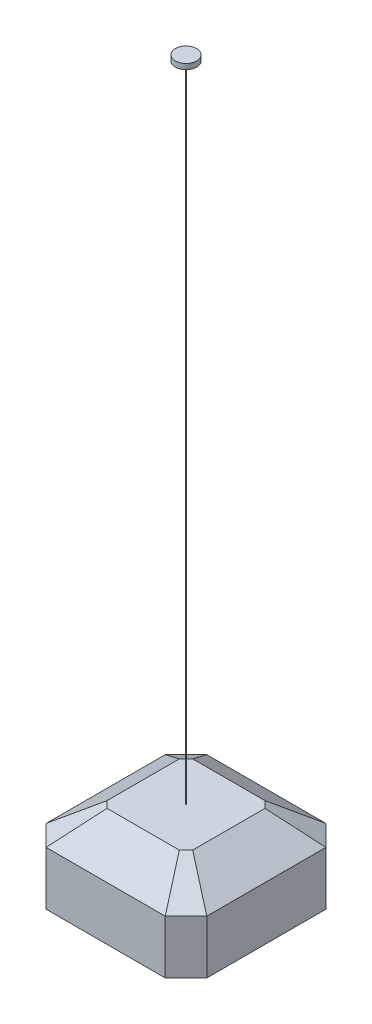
from build123d import *


with BuildPart() as part:
    # Croquis1 → Recubrir1 section 0
    with BuildSketch(Plane(origin=(0, 0, 0), x_dir=(1, 0, 0), z_dir=(0, 1, 0))):
        with BuildLine():
            Line((-160, 135), (-160, -135))
            Line((-160, -135), (-135, -160))
            Line((-135, -160), (135, -160))
            Line((135, -160), (160, -135))
            Line((160, -135), (160, 135))
            Line((160, 135), (135, 160))
            Line((135, 160), (-135, 160))
            Line((-135, 160), (-160, 135))
        make_face()
    # Croquis2 → Recubrir1 section 1
    with BuildSketch(Plane(origin=(0, 100, 0), x_dir=(1, 0, 0), z_dir=(0, 1, 0))):
        with BuildLine():
            Line((222.443825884, 300), (-222.443825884, 300))
            Line((-222.443825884, 300), (-300, 222.443825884))
            Line((-300, 222.443825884), (-300, -222.443825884))
            Line((-300, -222.443825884), (-222.443825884, -300))
            Line((-222.443825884, -300), (222.443825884, -300))
            Line((222.443825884, -300), (300, -222.443825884))
            Line((300, -222.443825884), (300, 222.443825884))
            Line((300, 222.443825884), (222.443825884, 300))
        make_face()
    loft()


with BuildPart() as body_2:
    # Croquis3 → Recubrir2 section 0
    with BuildSketch(Plane(origin=(0, 300, 0), x_dir=(1, 0, 0), z_dir=(0, 1, 0))):
        with BuildLine():
            Line((222.443825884, 300), (-222.443825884, 300))
            Line((-222.443825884, 300), (-300, 222.443825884))
            Line((-300, 222.443825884), (-300, -222.443825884))
            Line((-300, -222.443825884), (-222.443825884, -300))
            Line((-222.443825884, -300), (222.443825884, -300))
            Line((222.443825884, -300), (300, -222.443825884))
            Line((300, -222.443825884), (300, 222.443825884))
            Line((300, 222.443825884), (222.443825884, 300))
        make_face()
    # Croquis4 → Recubrir2 section 1
    with BuildSketch(Plane(origin=(0, 400, 0), x_dir=(1, 0, 0), z_dir=(0, 1, 0))):
        with BuildLine():
            Line((135, 160), (-135, 160))
            Line((-135, 160), (-160, 135))
            Line((-160, 135), (-160, -135))
            Line((-160, -135), (-135, -160))
            Line((-135, -160), (135, -160))
            Line((135, -160), (160, -135))
            Line((160, -135), (160, 135))
            Line((160, 135), (135, 160))
        make_face()
    loft()


with BuildPart() as part_1:
    add(part.part)

    add(body_2.part)  # Recubrir3 merges body 2
    # Croquis6 → Recubrir3 section 0
    with BuildSketch(Plane(origin=(0, 100, 0), x_dir=(1, 0, 0), z_dir=(0, 1, 0))):
        with BuildLine():
            Line((300, 222.443825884), (222.443825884, 300))
            Line((222.443825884, 300), (-222.443825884, 300))
            Line((-222.443825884, 300), (-300, 222.443825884))
            Line((-300, 222.443825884), (-300, -222.443825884))
            Line((-300, -222.443825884), (-222.443825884, -300))
            Line((-222.443825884, -300), (222.443825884, -300))
            Line((222.443825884, -300), (300, -222.443825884))
            Line((300, -222.443825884), (300, 222.443825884))
        make_face()
    # Croquis5 → Recubrir3 section 1
    with BuildSketch(Plane.XZ.offset(-300)):
        with BuildLine():
            Line((222.443825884, -300), (300, -222.443825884))
            Line((300, -222.443825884), (300, 222.443825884))
            Line((300, 222.443825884), (222.443825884, 300))
            Line((222.443825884, 300), (-222.443825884, 300))
            Line((-222.443825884, 300), (-300, 222.443825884))
            Line((-300, 222.443825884), (-300, -222.443825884))
            Line((-300, -222.443825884), (-222.443825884, -300))
            Line((-222.443825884, -300), (222.443825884, -300))
        make_face()
    loft()

    # Croquis7 → Revoluci_n1 (revolve)
    with BuildSketch(Plane.XY, mode=Mode.PRIVATE) as revoluci_n1_sk:
        Polygon((0, 400), (0, 2800), (0, 2825), (-40, 2825), (-40, 2805), (-5, 2805), (-5, 2800), (-1, 2800), (-1, 400), align=None)
    revolve(revoluci_n1_sk.sketch.rotate(Axis((0, 400, 0), (0, 1, 0)), 180), axis=Axis((0, 400, 0), (0, 1, 0)))


solid = part_1.part
